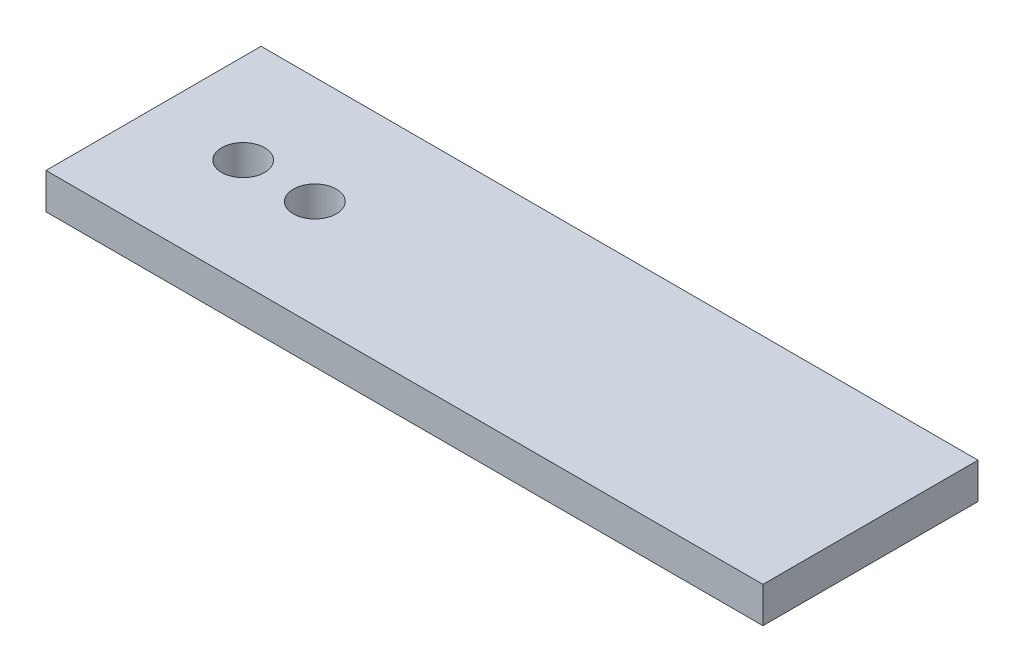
ISO-10303-21;
HEADER;
FILE_DESCRIPTION(('STEP AP214'),'2;1');
FILE_NAME('part.step','',(''),(''),'','','');
FILE_SCHEMA(('AUTOMOTIVE_DESIGN { 1 0 10303 214 1 1 1 1 }'));
ENDSEC;
DATA;
#1=APPLICATION_CONTEXT('core data for automotive mechanical design processes');
#2=APPLICATION_PROTOCOL_DEFINITION('international standard','automotive_design',2000,#1);
#3=PRODUCT_CONTEXT('',#1,'mechanical');
#4=PRODUCT('Part','Part','',(#3));
#5=PRODUCT_RELATED_PRODUCT_CATEGORY('part','',(#4));
#6=PRODUCT_DEFINITION_FORMATION('','',#4);
#7=PRODUCT_DEFINITION_CONTEXT('part definition',#1,'design');
#8=PRODUCT_DEFINITION('design','',#6,#7);
#9=PRODUCT_DEFINITION_SHAPE('','',#8);
#10=(LENGTH_UNIT() NAMED_UNIT(*) SI_UNIT(.MILLI.,.METRE.));
#11=(NAMED_UNIT(*) PLANE_ANGLE_UNIT() SI_UNIT($,.RADIAN.));
#12=(NAMED_UNIT(*) SI_UNIT($,.STERADIAN.) SOLID_ANGLE_UNIT());
#13=UNCERTAINTY_MEASURE_WITH_UNIT(LENGTH_MEASURE(1.E-05),#10,'distance_accuracy_value','');
#14=(GEOMETRIC_REPRESENTATION_CONTEXT(3) GLOBAL_UNCERTAINTY_ASSIGNED_CONTEXT((#13)) GLOBAL_UNIT_ASSIGNED_CONTEXT((#10,
#11,#12)) REPRESENTATION_CONTEXT('',''));
#15=CARTESIAN_POINT('',(0.,0.,0.));
#16=DIRECTION('',(0.,0.,1.));
#17=DIRECTION('',(1.,0.,0.));
#18=AXIS2_PLACEMENT_3D('',#15,#16,#17);
#19=CARTESIAN_POINT('',(0.,-10.,0.));
#20=DIRECTION('',(-1.,0.,0.));
#21=DIRECTION('',(0.,0.,1.));
#22=AXIS2_PLACEMENT_3D('',#19,#20,#21);
#23=PLANE('',#22);
#24=DIRECTION('',(0.,0.,1.));
#25=VECTOR('',#24,1.);
#26=CARTESIAN_POINT('',(0.,0.,0.));
#27=LINE('',#26,#25);
#28=CARTESIAN_POINT('',(0.,0.,-60.));
#29=VERTEX_POINT('',#28);
#30=CARTESIAN_POINT('',(0.,0.,0.));
#31=VERTEX_POINT('',#30);
#32=EDGE_CURVE('E102',#29,#31,#27,.T.);
#33=ORIENTED_EDGE('',*,*,#32,.F.);
#34=DIRECTION('',(0.,1.,0.));
#35=VECTOR('',#34,1.);
#36=CARTESIAN_POINT('',(0.,-10.,-60.));
#37=LINE('',#36,#35);
#38=CARTESIAN_POINT('',(0.,-10.,-60.));
#39=VERTEX_POINT('',#38);
#40=EDGE_CURVE('E11',#39,#29,#37,.T.);
#41=ORIENTED_EDGE('',*,*,#40,.F.);
#42=DIRECTION('',(0.,0.,1.));
#43=VECTOR('',#42,1.);
#44=CARTESIAN_POINT('',(0.,-10.,0.));
#45=LINE('',#44,#43);
#46=CARTESIAN_POINT('',(0.,-10.,0.));
#47=VERTEX_POINT('',#46);
#48=EDGE_CURVE('E100',#39,#47,#45,.T.);
#49=ORIENTED_EDGE('',*,*,#48,.T.);
#50=DIRECTION('',(0.,1.,0.));
#51=VECTOR('',#50,1.);
#52=CARTESIAN_POINT('',(0.,-10.,0.));
#53=LINE('',#52,#51);
#54=EDGE_CURVE('E45',#47,#31,#53,.T.);
#55=ORIENTED_EDGE('',*,*,#54,.T.);
#56=EDGE_LOOP('',(#33,#41,#49,#55));
#57=FACE_BOUND('',#56,.T.);
#58=ADVANCED_FACE('F39',(#57),#23,.T.);
#59=CARTESIAN_POINT('',(0.,-10.,-60.));
#60=DIRECTION('',(0.,0.,-1.));
#61=DIRECTION('',(-1.,0.,0.));
#62=AXIS2_PLACEMENT_3D('',#59,#60,#61);
#63=PLANE('',#62);
#64=DIRECTION('',(-1.,0.,0.));
#65=VECTOR('',#64,1.);
#66=CARTESIAN_POINT('',(0.,0.,-60.));
#67=LINE('',#66,#65);
#68=CARTESIAN_POINT('',(200.,0.,-60.));
#69=VERTEX_POINT('',#68);
#70=EDGE_CURVE('E97',#69,#29,#67,.T.);
#71=ORIENTED_EDGE('',*,*,#70,.F.);
#72=DIRECTION('',(0.,1.,0.));
#73=VECTOR('',#72,1.);
#74=CARTESIAN_POINT('',(200.,-10.,-60.));
#75=LINE('',#74,#73);
#76=CARTESIAN_POINT('',(200.,-10.,-60.));
#77=VERTEX_POINT('',#76);
#78=EDGE_CURVE('E48',#77,#69,#75,.T.);
#79=ORIENTED_EDGE('',*,*,#78,.F.);
#80=DIRECTION('',(-1.,0.,0.));
#81=VECTOR('',#80,1.);
#82=CARTESIAN_POINT('',(0.,-10.,-60.));
#83=LINE('',#82,#81);
#84=EDGE_CURVE('E94',#77,#39,#83,.T.);
#85=ORIENTED_EDGE('',*,*,#84,.T.);
#86=ORIENTED_EDGE('',*,*,#40,.T.);
#87=EDGE_LOOP('',(#71,#79,#85,#86));
#88=FACE_BOUND('',#87,.T.);
#89=ADVANCED_FACE('F113',(#88),#63,.T.);
#90=CARTESIAN_POINT('',(200.,-10.,0.));
#91=DIRECTION('',(1.,0.,0.));
#92=DIRECTION('',(0.,0.,-1.));
#93=AXIS2_PLACEMENT_3D('',#90,#91,#92);
#94=PLANE('',#93);
#95=DIRECTION('',(0.,0.,-1.));
#96=VECTOR('',#95,1.);
#97=CARTESIAN_POINT('',(200.,0.,0.));
#98=LINE('',#97,#96);
#99=CARTESIAN_POINT('',(200.,0.,0.));
#100=VERTEX_POINT('',#99);
#101=EDGE_CURVE('E90',#100,#69,#98,.T.);
#102=ORIENTED_EDGE('',*,*,#101,.F.);
#103=DIRECTION('',(0.,1.,0.));
#104=VECTOR('',#103,1.);
#105=CARTESIAN_POINT('',(200.,-10.,0.));
#106=LINE('',#105,#104);
#107=CARTESIAN_POINT('',(200.,-10.,0.));
#108=VERTEX_POINT('',#107);
#109=EDGE_CURVE('E83',#108,#100,#106,.T.);
#110=ORIENTED_EDGE('',*,*,#109,.F.);
#111=DIRECTION('',(0.,0.,-1.));
#112=VECTOR('',#111,1.);
#113=CARTESIAN_POINT('',(200.,-10.,0.));
#114=LINE('',#113,#112);
#115=EDGE_CURVE('E87',#108,#77,#114,.T.);
#116=ORIENTED_EDGE('',*,*,#115,.T.);
#117=ORIENTED_EDGE('',*,*,#78,.T.);
#118=EDGE_LOOP('',(#102,#110,#116,#117));
#119=FACE_BOUND('',#118,.T.);
#120=ADVANCED_FACE('F88',(#119),#94,.T.);
#121=CARTESIAN_POINT('',(0.,-10.,0.));
#122=DIRECTION('',(0.,0.,1.));
#123=DIRECTION('',(1.,0.,0.));
#124=AXIS2_PLACEMENT_3D('',#121,#122,#123);
#125=PLANE('',#124);
#126=DIRECTION('',(1.,0.,0.));
#127=VECTOR('',#126,1.);
#128=CARTESIAN_POINT('',(0.,0.,0.));
#129=LINE('',#128,#127);
#130=EDGE_CURVE('E110',#31,#100,#129,.T.);
#131=ORIENTED_EDGE('',*,*,#130,.F.);
#132=ORIENTED_EDGE('',*,*,#54,.F.);
#133=DIRECTION('',(1.,0.,0.));
#134=VECTOR('',#133,1.);
#135=CARTESIAN_POINT('',(0.,-10.,0.));
#136=LINE('',#135,#134);
#137=EDGE_CURVE('E91',#47,#108,#136,.T.);
#138=ORIENTED_EDGE('',*,*,#137,.T.);
#139=ORIENTED_EDGE('',*,*,#109,.T.);
#140=EDGE_LOOP('',(#131,#132,#138,#139));
#141=FACE_BOUND('',#140,.T.);
#142=ADVANCED_FACE('F96',(#141),#125,.T.);
#143=CARTESIAN_POINT('',(0.,-10.,0.));
#144=DIRECTION('',(0.,-1.,0.));
#145=DIRECTION('',(0.,0.,-1.));
#146=AXIS2_PLACEMENT_3D('',#143,#144,#145);
#147=PLANE('',#146);
#148=CARTESIAN_POINT('',(45.,-10.,-30.));
#149=DIRECTION('',(0.,1.,0.));
#150=DIRECTION('',(0.,0.,1.));
#151=AXIS2_PLACEMENT_3D('',#148,#149,#150);
#152=CIRCLE('',#151,6.);
#153=CARTESIAN_POINT('',(45.,-10.,-24.));
#154=VERTEX_POINT('',#153);
#155=EDGE_CURVE('E146',#154,#154,#152,.T.);
#156=ORIENTED_EDGE('',*,*,#155,.T.);
#157=EDGE_LOOP('',(#156));
#158=FACE_BOUND('',#157,.T.);
#159=CARTESIAN_POINT('',(25.,-10.,-30.));
#160=DIRECTION('',(0.,1.,0.));
#161=DIRECTION('',(0.,0.,1.));
#162=AXIS2_PLACEMENT_3D('',#159,#160,#161);
#163=CIRCLE('',#162,6.);
#164=CARTESIAN_POINT('',(25.,-10.,-24.));
#165=VERTEX_POINT('',#164);
#166=EDGE_CURVE('E107',#165,#165,#163,.T.);
#167=ORIENTED_EDGE('',*,*,#166,.T.);
#168=EDGE_LOOP('',(#167));
#169=FACE_BOUND('',#168,.T.);
#170=ORIENTED_EDGE('',*,*,#48,.F.);
#171=ORIENTED_EDGE('',*,*,#84,.F.);
#172=ORIENTED_EDGE('',*,*,#115,.F.);
#173=ORIENTED_EDGE('',*,*,#137,.F.);
#174=EDGE_LOOP('',(#170,#171,#172,#173));
#175=FACE_BOUND('',#174,.T.);
#176=ADVANCED_FACE('F95',(#158,#169,#175),#147,.T.);
#177=CARTESIAN_POINT('',(0.,0.,0.));
#178=DIRECTION('',(0.,-1.,0.));
#179=DIRECTION('',(0.,0.,-1.));
#180=AXIS2_PLACEMENT_3D('',#177,#178,#179);
#181=PLANE('',#180);
#182=CARTESIAN_POINT('',(45.,0.,-30.));
#183=DIRECTION('',(0.,1.,0.));
#184=DIRECTION('',(0.,0.,1.));
#185=AXIS2_PLACEMENT_3D('',#182,#183,#184);
#186=CIRCLE('',#185,6.);
#187=CARTESIAN_POINT('',(45.,0.,-24.));
#188=VERTEX_POINT('',#187);
#189=EDGE_CURVE('E151',#188,#188,#186,.T.);
#190=ORIENTED_EDGE('',*,*,#189,.F.);
#191=EDGE_LOOP('',(#190));
#192=FACE_BOUND('',#191,.T.);
#193=CARTESIAN_POINT('',(25.,0.,-30.));
#194=DIRECTION('',(0.,1.,0.));
#195=DIRECTION('',(0.,0.,1.));
#196=AXIS2_PLACEMENT_3D('',#193,#194,#195);
#197=CIRCLE('',#196,6.);
#198=CARTESIAN_POINT('',(25.,0.,-24.));
#199=VERTEX_POINT('',#198);
#200=EDGE_CURVE('E153',#199,#199,#197,.T.);
#201=ORIENTED_EDGE('',*,*,#200,.F.);
#202=EDGE_LOOP('',(#201));
#203=FACE_BOUND('',#202,.T.);
#204=ORIENTED_EDGE('',*,*,#32,.T.);
#205=ORIENTED_EDGE('',*,*,#130,.T.);
#206=ORIENTED_EDGE('',*,*,#101,.T.);
#207=ORIENTED_EDGE('',*,*,#70,.T.);
#208=EDGE_LOOP('',(#204,#205,#206,#207));
#209=FACE_BOUND('',#208,.T.);
#210=ADVANCED_FACE('F111',(#192,#203,#209),#181,.F.);
#211=CARTESIAN_POINT('',(25.,-10.,-30.));
#212=DIRECTION('',(0.,1.,0.));
#213=DIRECTION('',(0.,0.,1.));
#214=AXIS2_PLACEMENT_3D('',#211,#212,#213);
#215=CYLINDRICAL_SURFACE('',#214,6.);
#216=ORIENTED_EDGE('',*,*,#166,.F.);
#217=EDGE_LOOP('',(#216));
#218=FACE_BOUND('',#217,.T.);
#219=ORIENTED_EDGE('',*,*,#200,.T.);
#220=EDGE_LOOP('',(#219));
#221=FACE_BOUND('',#220,.T.);
#222=ADVANCED_FACE('F135',(#218,#221),#215,.F.);
#223=CARTESIAN_POINT('',(45.,-10.,-30.));
#224=DIRECTION('',(0.,1.,0.));
#225=DIRECTION('',(0.,0.,1.));
#226=AXIS2_PLACEMENT_3D('',#223,#224,#225);
#227=CYLINDRICAL_SURFACE('',#226,6.);
#228=ORIENTED_EDGE('',*,*,#155,.F.);
#229=EDGE_LOOP('',(#228));
#230=FACE_BOUND('',#229,.T.);
#231=ORIENTED_EDGE('',*,*,#189,.T.);
#232=EDGE_LOOP('',(#231));
#233=FACE_BOUND('',#232,.T.);
#234=ADVANCED_FACE('F137',(#230,#233),#227,.F.);
#235=CLOSED_SHELL('',(#58,#89,#120,#142,#176,#210,#222,#234));
#236=MANIFOLD_SOLID_BREP('B2',#235);
#237=ADVANCED_BREP_SHAPE_REPRESENTATION('',(#18,#236),#14);
#238=SHAPE_DEFINITION_REPRESENTATION(#9,#237);
ENDSEC;
END-ISO-10303-21;
